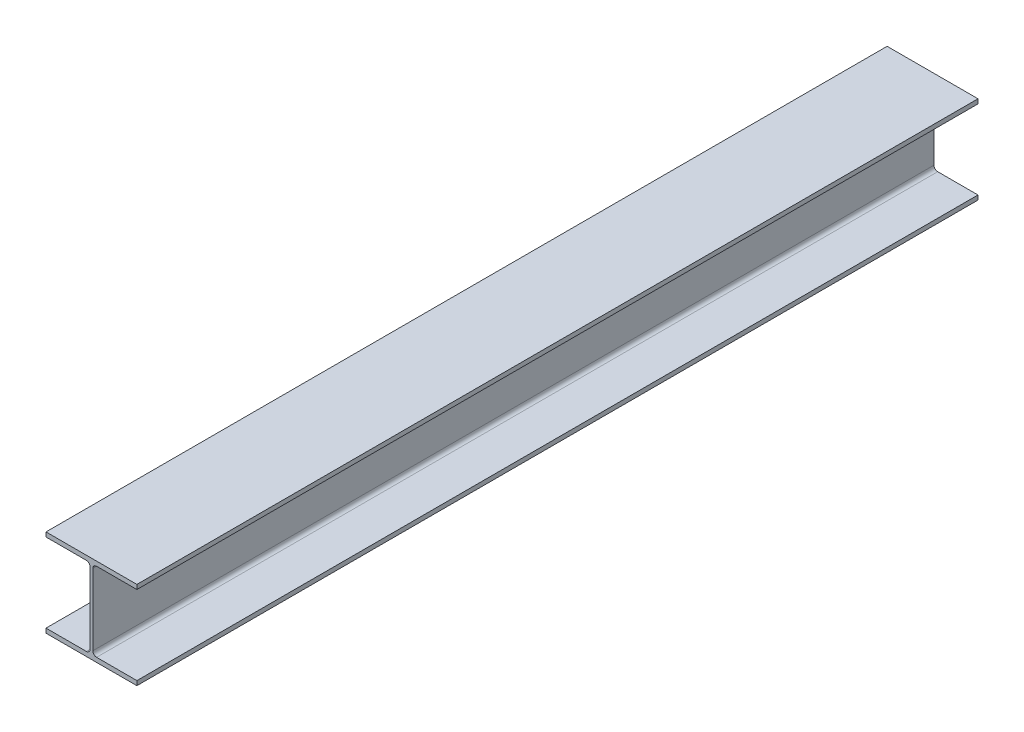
from build123d import *

# Parameters (mm, degrees)
BOSS_EXTRUDE1_DEPTH = 3413.125


with BuildPart() as part:
    # sk W14x283 → Boss-Extrude1 (new body)
    with BuildSketch(Plane.XY):
        with BuildLine():
            Line((-184.404, -178.054), (-184.404, -160.02))
            Line((-184.404, -160.02), (-20.828, -160.02))
            ThreePointArc((-20.828, -160.02), (-10.051692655, -155.556307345), (-5.588, -144.78))
            Line((-5.588, -144.78), (-5.588, 144.78))
            ThreePointArc((-5.588, 144.78), (-10.051692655, 155.556307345), (-20.828, 160.02))
            Line((-20.828, 160.02), (-184.404, 160.02))
            Line((-184.404, 160.02), (-184.404, 178.054))
            Line((-184.404, 178.054), (184.404, 178.054))
            Line((184.404, 178.054), (184.404, 160.02))
            Line((184.404, 160.02), (20.828, 160.02))
            ThreePointArc((20.828, 160.02), (10.051692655, 155.556307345), (5.588, 144.78))
            Line((5.588, 144.78), (5.588, -144.78))
            ThreePointArc((5.588, -144.78), (10.051692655, -155.556307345), (20.828, -160.02))
            Line((20.828, -160.02), (184.404, -160.02))
            Line((184.404, -160.02), (184.404, -178.054))
            Line((184.404, -178.054), (-184.404, -178.054))
        make_face()
    extrude(amount=BOSS_EXTRUDE1_DEPTH)


solid = part.part
